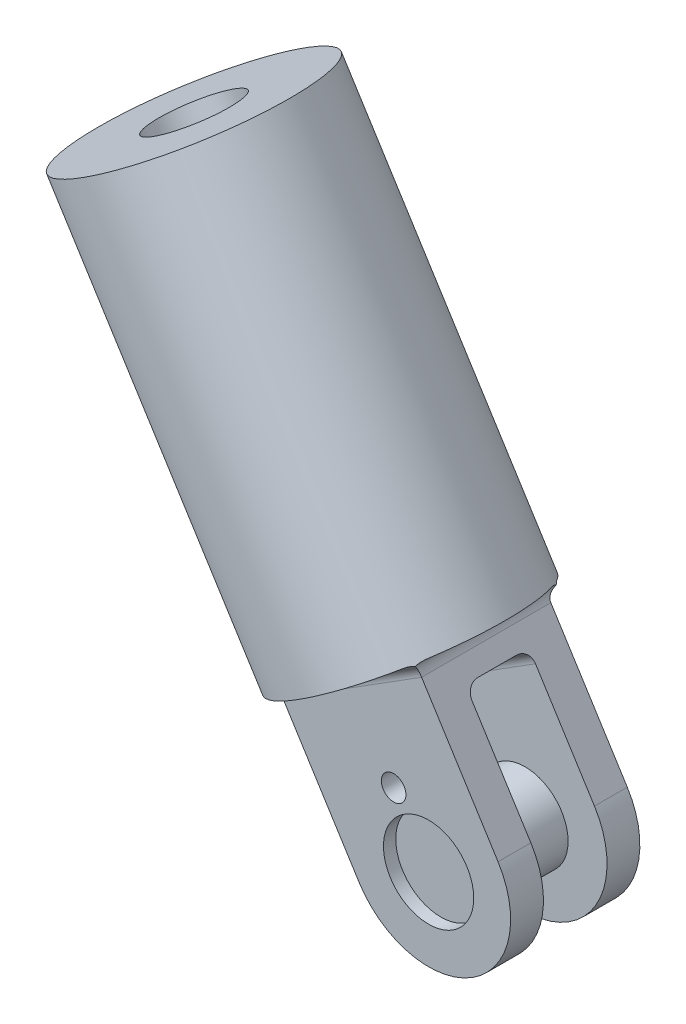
ISO-10303-21;
HEADER;
FILE_DESCRIPTION(('STEP AP214'),'2;1');
FILE_NAME('part.step','',(''),(''),'','','');
FILE_SCHEMA(('AUTOMOTIVE_DESIGN { 1 0 10303 214 1 1 1 1 }'));
ENDSEC;
DATA;
#1=APPLICATION_CONTEXT('core data for automotive mechanical design processes');
#2=APPLICATION_PROTOCOL_DEFINITION('international standard','automotive_design',2000,#1);
#3=PRODUCT_CONTEXT('',#1,'mechanical');
#4=PRODUCT('Part','Part','',(#3));
#5=PRODUCT_RELATED_PRODUCT_CATEGORY('part','',(#4));
#6=PRODUCT_DEFINITION_FORMATION('','',#4);
#7=PRODUCT_DEFINITION_CONTEXT('part definition',#1,'design');
#8=PRODUCT_DEFINITION('design','',#6,#7);
#9=PRODUCT_DEFINITION_SHAPE('','',#8);
#10=(LENGTH_UNIT() NAMED_UNIT(*) SI_UNIT(.MILLI.,.METRE.));
#11=(NAMED_UNIT(*) PLANE_ANGLE_UNIT() SI_UNIT($,.RADIAN.));
#12=(NAMED_UNIT(*) SI_UNIT($,.STERADIAN.) SOLID_ANGLE_UNIT());
#13=UNCERTAINTY_MEASURE_WITH_UNIT(LENGTH_MEASURE(1.E-05),#10,'distance_accuracy_value','');
#14=(GEOMETRIC_REPRESENTATION_CONTEXT(3) GLOBAL_UNCERTAINTY_ASSIGNED_CONTEXT((#13)) GLOBAL_UNIT_ASSIGNED_CONTEXT((#10,
#11,#12)) REPRESENTATION_CONTEXT('',''));
#15=CARTESIAN_POINT('',(0.,0.,0.));
#16=DIRECTION('',(0.,0.,1.));
#17=DIRECTION('',(1.,0.,0.));
#18=AXIS2_PLACEMENT_3D('',#15,#16,#17);
#19=CARTESIAN_POINT('',(30.0521732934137,5.94644816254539,-27.5));
#20=DIRECTION('',(0.,0.,1.));
#21=DIRECTION('',(1.,0.,0.));
#22=AXIS2_PLACEMENT_3D('',#19,#20,#21);
#23=CYLINDRICAL_SURFACE('',#22,11.);
#24=CARTESIAN_POINT('',(30.0521732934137,5.94644816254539,-15.75));
#25=DIRECTION('',(0.,0.,-1.));
#26=DIRECTION('',(-1.,0.,0.));
#27=AXIS2_PLACEMENT_3D('',#24,#25,#26);
#28=CIRCLE('',#27,11.);
#29=CARTESIAN_POINT('',(19.0521732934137,5.94644816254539,-15.75));
#30=VERTEX_POINT('',#29);
#31=EDGE_CURVE('E655',#30,#30,#28,.T.);
#32=ORIENTED_EDGE('',*,*,#31,.T.);
#33=EDGE_LOOP('',(#32));
#34=FACE_BOUND('',#33,.T.);
#35=CARTESIAN_POINT('',(30.0521732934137,5.94644816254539,-12.75));
#36=DIRECTION('',(0.,0.,1.));
#37=DIRECTION('',(1.,0.,0.));
#38=AXIS2_PLACEMENT_3D('',#35,#36,#37);
#39=CIRCLE('',#38,11.);
#40=CARTESIAN_POINT('',(41.0521732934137,5.94644816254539,-12.75));
#41=VERTEX_POINT('',#40);
#42=EDGE_CURVE('E11',#41,#41,#39,.F.);
#43=ORIENTED_EDGE('',*,*,#42,.F.);
#44=EDGE_LOOP('',(#43));
#45=FACE_BOUND('',#44,.T.);
#46=ADVANCED_FACE('F36',(#34,#45),#23,.F.);
#47=CARTESIAN_POINT('',(30.0521732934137,5.94644816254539,15.75));
#48=DIRECTION('',(0.,0.,1.));
#49=DIRECTION('',(1.,0.,0.));
#50=AXIS2_PLACEMENT_3D('',#47,#48,#49);
#51=CIRCLE('',#50,11.);
#52=CARTESIAN_POINT('',(41.0521732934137,5.94644816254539,15.75));
#53=VERTEX_POINT('',#52);
#54=EDGE_CURVE('E653',#53,#53,#51,.T.);
#55=ORIENTED_EDGE('',*,*,#54,.T.);
#56=EDGE_LOOP('',(#55));
#57=FACE_BOUND('',#56,.T.);
#58=CARTESIAN_POINT('',(30.0521732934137,5.94644816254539,12.75));
#59=DIRECTION('',(0.,0.,-1.));
#60=DIRECTION('',(-1.,0.,0.));
#61=AXIS2_PLACEMENT_3D('',#58,#59,#60);
#62=CIRCLE('',#61,11.);
#63=CARTESIAN_POINT('',(19.0521732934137,5.94644816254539,12.75));
#64=VERTEX_POINT('',#63);
#65=EDGE_CURVE('E45',#64,#64,#62,.F.);
#66=ORIENTED_EDGE('',*,*,#65,.F.);
#67=EDGE_LOOP('',(#66));
#68=FACE_BOUND('',#67,.T.);
#69=ADVANCED_FACE('F334',(#57,#68),#23,.F.);
#70=CARTESIAN_POINT('',(9.82377228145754,38.1149388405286,0.));
#71=DIRECTION('',(-0.532326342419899,0.846539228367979,0.));
#72=DIRECTION('',(-0.846539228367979,-0.532326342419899,0.));
#73=AXIS2_PLACEMENT_3D('',#70,#71,#72);
#74=PLANE('',#73);
#75=CARTESIAN_POINT('',(9.82377228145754,38.1149388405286,0.));
#76=DIRECTION('',(-0.532326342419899,0.846539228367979,0.));
#77=DIRECTION('',(-0.846539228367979,-0.532326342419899,0.));
#78=AXIS2_PLACEMENT_3D('',#75,#76,#77);
#79=CIRCLE('',#78,27.5);
#80=CARTESIAN_POINT('',(29.294174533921,50.3584447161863,15.0748134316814));
#81=VERTEX_POINT('',#80);
#82=CARTESIAN_POINT('',(29.294174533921,50.3584447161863,-15.0748134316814));
#83=VERTEX_POINT('',#82);
#84=EDGE_CURVE('E410',#81,#83,#79,.T.);
#85=ORIENTED_EDGE('',*,*,#84,.F.);
#86=DIRECTION('',(0.,0.,-1.));
#87=VECTOR('',#86,1.);
#88=CARTESIAN_POINT('',(29.294174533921,50.3584447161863,-15.75));
#89=LINE('',#88,#87);
#90=EDGE_CURVE('E237',#81,#83,#89,.T.);
#91=ORIENTED_EDGE('',*,*,#90,.T.);
#92=EDGE_LOOP('',(#85,#91));
#93=FACE_BOUND('',#92,.T.);
#94=ADVANCED_FACE('F336',(#93),#74,.F.);
#95=CARTESIAN_POINT('',(26.8534717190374,48.8236659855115,-18.75));
#96=VERTEX_POINT('',#95);
#97=CARTESIAN_POINT('',(-7.20592715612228,27.4062116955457,-18.75));
#98=VERTEX_POINT('',#97);
#99=EDGE_CURVE('E395',#96,#98,#79,.T.);
#100=ORIENTED_EDGE('',*,*,#99,.F.);
#101=DIRECTION('',(-0.846539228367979,-0.532326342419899,0.));
#102=VECTOR('',#101,1.);
#103=CARTESIAN_POINT('',(9.82377228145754,38.1149388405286,-18.75));
#104=LINE('',#103,#102);
#105=EDGE_CURVE('E235',#96,#98,#104,.T.);
#106=ORIENTED_EDGE('',*,*,#105,.T.);
#107=EDGE_LOOP('',(#100,#106));
#108=FACE_BOUND('',#107,.T.);
#109=ADVANCED_FACE('F343',(#108),#74,.F.);
#110=CARTESIAN_POINT('',(-9.646629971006,25.8714329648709,-15.0748134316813));
#111=VERTEX_POINT('',#110);
#112=CARTESIAN_POINT('',(-9.646629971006,25.8714329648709,15.0748134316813));
#113=VERTEX_POINT('',#112);
#114=EDGE_CURVE('E393',#111,#113,#79,.T.);
#115=ORIENTED_EDGE('',*,*,#114,.F.);
#116=DIRECTION('',(0.,0.,1.));
#117=VECTOR('',#116,1.);
#118=CARTESIAN_POINT('',(-9.646629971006,25.8714329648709,15.75));
#119=LINE('',#118,#117);
#120=EDGE_CURVE('E233',#111,#113,#119,.T.);
#121=ORIENTED_EDGE('',*,*,#120,.T.);
#122=EDGE_LOOP('',(#115,#121));
#123=FACE_BOUND('',#122,.T.);
#124=ADVANCED_FACE('F374',(#123),#74,.F.);
#125=CARTESIAN_POINT('',(13.1213887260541,-4.70007868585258,-15.75));
#126=DIRECTION('',(0.846539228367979,0.532326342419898,0.));
#127=DIRECTION('',(-0.532326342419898,0.846539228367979,0.));
#128=AXIS2_PLACEMENT_3D('',#125,#126,#127);
#129=PLANE('',#128);
#130=DIRECTION('',(0.532326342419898,-0.846539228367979,0.));
#131=VECTOR('',#130,1.);
#132=CARTESIAN_POINT('',(-102.93078456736,179.853473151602,15.75));
#133=LINE('',#132,#131);
#134=CARTESIAN_POINT('',(-5.51003325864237,24.9287943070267,15.75));
#135=VERTEX_POINT('',#134);
#136=CARTESIAN_POINT('',(13.1213887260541,-4.70007868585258,15.75));
#137=VERTEX_POINT('',#136);
#138=EDGE_CURVE('E203',#135,#137,#133,.T.);
#139=ORIENTED_EDGE('',*,*,#138,.F.);
#140=DIRECTION('',(0.,0.,1.));
#141=VECTOR('',#140,1.);
#142=CARTESIAN_POINT('',(-5.51003325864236,24.9287943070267,-15.75));
#143=LINE('',#142,#141);
#144=CARTESIAN_POINT('',(-5.51003325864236,24.9287943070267,-15.75));
#145=VERTEX_POINT('',#144);
#146=EDGE_CURVE('E245',#135,#145,#143,.F.);
#147=ORIENTED_EDGE('',*,*,#146,.T.);
#148=DIRECTION('',(-0.532326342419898,0.846539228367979,0.));
#149=VECTOR('',#148,1.);
#150=CARTESIAN_POINT('',(13.1213887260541,-4.70007868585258,-15.75));
#151=LINE('',#150,#149);
#152=CARTESIAN_POINT('',(13.1213887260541,-4.70007868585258,-15.75));
#153=VERTEX_POINT('',#152);
#154=EDGE_CURVE('E189',#153,#145,#151,.T.);
#155=ORIENTED_EDGE('',*,*,#154,.F.);
#156=DIRECTION('',(0.,0.,1.));
#157=VECTOR('',#156,1.);
#158=CARTESIAN_POINT('',(13.1213887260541,-4.70007868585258,-15.75));
#159=LINE('',#158,#157);
#160=CARTESIAN_POINT('',(13.1213887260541,-4.70007868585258,-7.75));
#161=VERTEX_POINT('',#160);
#162=EDGE_CURVE('E165',#153,#161,#159,.T.);
#163=ORIENTED_EDGE('',*,*,#162,.T.);
#164=DIRECTION('',(-0.532326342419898,0.846539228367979,0.));
#165=VECTOR('',#164,1.);
#166=CARTESIAN_POINT('',(13.1213887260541,-4.70007868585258,-7.75));
#167=LINE('',#166,#165);
#168=CARTESIAN_POINT('',(-1.25142251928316,18.1564804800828,-7.75));
#169=VERTEX_POINT('',#168);
#170=EDGE_CURVE('E179',#161,#169,#167,.T.);
#171=ORIENTED_EDGE('',*,*,#170,.T.);
#172=CARTESIAN_POINT('',(-1.25142251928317,18.1564804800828,-4.75));
#173=DIRECTION('',(0.846539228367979,0.532326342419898,0.));
#174=DIRECTION('',(-0.532326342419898,0.846539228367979,0.));
#175=AXIS2_PLACEMENT_3D('',#172,#173,#174);
#176=CIRCLE('',#175,3.);
#177=CARTESIAN_POINT('',(-2.84840154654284,20.6960981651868,-4.75));
#178=VERTEX_POINT('',#177);
#179=EDGE_CURVE('E228',#169,#178,#176,.T.);
#180=ORIENTED_EDGE('',*,*,#179,.T.);
#181=DIRECTION('',(0.,0.,1.));
#182=VECTOR('',#181,1.);
#183=CARTESIAN_POINT('',(-2.84840154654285,20.6960981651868,-15.75));
#184=LINE('',#183,#182);
#185=CARTESIAN_POINT('',(-2.84840154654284,20.6960981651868,4.75));
#186=VERTEX_POINT('',#185);
#187=EDGE_CURVE('E208',#178,#186,#184,.T.);
#188=ORIENTED_EDGE('',*,*,#187,.T.);
#189=CARTESIAN_POINT('',(-1.25142251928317,18.1564804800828,4.75));
#190=DIRECTION('',(0.846539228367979,0.532326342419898,0.));
#191=DIRECTION('',(-0.532326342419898,0.846539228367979,0.));
#192=AXIS2_PLACEMENT_3D('',#189,#190,#191);
#193=CIRCLE('',#192,3.);
#194=CARTESIAN_POINT('',(-1.25142251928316,18.1564804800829,7.75));
#195=VERTEX_POINT('',#194);
#196=EDGE_CURVE('E226',#186,#195,#193,.T.);
#197=ORIENTED_EDGE('',*,*,#196,.T.);
#198=DIRECTION('',(0.532326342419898,-0.846539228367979,0.));
#199=VECTOR('',#198,1.);
#200=CARTESIAN_POINT('',(-102.93078456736,179.853473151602,7.75));
#201=LINE('',#200,#199);
#202=CARTESIAN_POINT('',(13.1213887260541,-4.70007868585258,7.75));
#203=VERTEX_POINT('',#202);
#204=EDGE_CURVE('E193',#195,#203,#201,.T.);
#205=ORIENTED_EDGE('',*,*,#204,.T.);
#206=DIRECTION('',(0.,0.,-1.));
#207=VECTOR('',#206,1.);
#208=CARTESIAN_POINT('',(13.1213887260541,-4.70007868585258,15.75));
#209=LINE('',#208,#207);
#210=EDGE_CURVE('E195',#137,#203,#209,.T.);
#211=ORIENTED_EDGE('',*,*,#210,.F.);
#212=EDGE_LOOP('',(#139,#147,#155,#163,#171,#180,#188,#197,#205,#211));
#213=FACE_BOUND('',#212,.T.);
#214=ADVANCED_FACE('F383',(#213),#129,.F.);
#215=CARTESIAN_POINT('',(46.9829578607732,16.5929750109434,-15.75));
#216=DIRECTION('',(-0.846539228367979,-0.532326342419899,0.));
#217=DIRECTION('',(0.532326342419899,-0.846539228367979,0.));
#218=AXIS2_PLACEMENT_3D('',#215,#216,#217);
#219=PLANE('',#218);
#220=DIRECTION('',(0.532326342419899,-0.846539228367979,0.));
#221=VECTOR('',#220,1.);
#222=CARTESIAN_POINT('',(46.9829578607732,16.5929750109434,-15.75));
#223=LINE('',#222,#221);
#224=CARTESIAN_POINT('',(28.3515358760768,46.2218480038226,-15.75));
#225=VERTEX_POINT('',#224);
#226=CARTESIAN_POINT('',(46.9829578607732,16.5929750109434,-15.75));
#227=VERTEX_POINT('',#226);
#228=EDGE_CURVE('E164',#225,#227,#223,.T.);
#229=ORIENTED_EDGE('',*,*,#228,.F.);
#230=DIRECTION('',(0.,0.,-1.));
#231=VECTOR('',#230,1.);
#232=CARTESIAN_POINT('',(28.3515358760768,46.2218480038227,15.75));
#233=LINE('',#232,#231);
#234=CARTESIAN_POINT('',(28.3515358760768,46.2218480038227,15.75));
#235=VERTEX_POINT('',#234);
#236=EDGE_CURVE('E240',#225,#235,#233,.F.);
#237=ORIENTED_EDGE('',*,*,#236,.T.);
#238=DIRECTION('',(-0.532326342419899,0.846539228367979,0.));
#239=VECTOR('',#238,1.);
#240=CARTESIAN_POINT('',(46.9829578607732,16.5929750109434,15.75));
#241=LINE('',#240,#239);
#242=CARTESIAN_POINT('',(46.9829578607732,16.5929750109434,15.75));
#243=VERTEX_POINT('',#242);
#244=EDGE_CURVE('E181',#243,#235,#241,.T.);
#245=ORIENTED_EDGE('',*,*,#244,.F.);
#246=DIRECTION('',(0.,0.,-1.));
#247=VECTOR('',#246,1.);
#248=CARTESIAN_POINT('',(46.9829578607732,16.5929750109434,15.75));
#249=LINE('',#248,#247);
#250=CARTESIAN_POINT('',(46.9829578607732,16.5929750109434,7.75));
#251=VERTEX_POINT('',#250);
#252=EDGE_CURVE('E190',#243,#251,#249,.T.);
#253=ORIENTED_EDGE('',*,*,#252,.T.);
#254=DIRECTION('',(-0.532326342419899,0.846539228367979,0.));
#255=VECTOR('',#254,1.);
#256=CARTESIAN_POINT('',(46.9829578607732,16.5929750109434,7.75));
#257=LINE('',#256,#255);
#258=CARTESIAN_POINT('',(32.610146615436,39.4495341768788,7.75));
#259=VERTEX_POINT('',#258);
#260=EDGE_CURVE('E194',#251,#259,#257,.T.);
#261=ORIENTED_EDGE('',*,*,#260,.T.);
#262=CARTESIAN_POINT('',(32.610146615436,39.4495341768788,4.75));
#263=DIRECTION('',(-0.846539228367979,-0.532326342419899,0.));
#264=DIRECTION('',(0.532326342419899,-0.846539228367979,0.));
#265=AXIS2_PLACEMENT_3D('',#262,#263,#264);
#266=CIRCLE('',#265,3.);
#267=CARTESIAN_POINT('',(31.0131675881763,41.9891518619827,4.75));
#268=VERTEX_POINT('',#267);
#269=EDGE_CURVE('E224',#259,#268,#266,.T.);
#270=ORIENTED_EDGE('',*,*,#269,.T.);
#271=DIRECTION('',(0.,0.,-1.));
#272=VECTOR('',#271,1.);
#273=CARTESIAN_POINT('',(31.0131675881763,41.9891518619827,-15.75));
#274=LINE('',#273,#272);
#275=CARTESIAN_POINT('',(31.0131675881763,41.9891518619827,-4.75));
#276=VERTEX_POINT('',#275);
#277=EDGE_CURVE('E409',#268,#276,#274,.T.);
#278=ORIENTED_EDGE('',*,*,#277,.T.);
#279=CARTESIAN_POINT('',(32.610146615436,39.4495341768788,-4.75));
#280=DIRECTION('',(-0.846539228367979,-0.532326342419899,0.));
#281=DIRECTION('',(0.532326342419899,-0.846539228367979,0.));
#282=AXIS2_PLACEMENT_3D('',#279,#280,#281);
#283=CIRCLE('',#282,3.);
#284=CARTESIAN_POINT('',(32.610146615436,39.4495341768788,-7.75));
#285=VERTEX_POINT('',#284);
#286=EDGE_CURVE('E159',#276,#285,#283,.T.);
#287=ORIENTED_EDGE('',*,*,#286,.T.);
#288=DIRECTION('',(0.532326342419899,-0.846539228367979,0.));
#289=VECTOR('',#288,1.);
#290=CARTESIAN_POINT('',(46.9829578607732,16.5929750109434,-7.75));
#291=LINE('',#290,#289);
#292=CARTESIAN_POINT('',(46.9829578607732,16.5929750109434,-7.75));
#293=VERTEX_POINT('',#292);
#294=EDGE_CURVE('E151',#285,#293,#291,.T.);
#295=ORIENTED_EDGE('',*,*,#294,.T.);
#296=DIRECTION('',(0.,0.,1.));
#297=VECTOR('',#296,1.);
#298=CARTESIAN_POINT('',(46.9829578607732,16.5929750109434,-15.75));
#299=LINE('',#298,#297);
#300=EDGE_CURVE('E155',#227,#293,#299,.T.);
#301=ORIENTED_EDGE('',*,*,#300,.F.);
#302=EDGE_LOOP('',(#229,#237,#245,#253,#261,#270,#278,#287,#295,#301));
#303=FACE_BOUND('',#302,.T.);
#304=ADVANCED_FACE('F154',(#303),#219,.F.);
#305=CARTESIAN_POINT('',(30.0521732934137,5.94644816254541,-15.75));
#306=DIRECTION('',(0.,0.,-1.));
#307=DIRECTION('',(-1.,0.,0.));
#308=AXIS2_PLACEMENT_3D('',#305,#306,#307);
#309=PLANE('',#308);
#310=ORIENTED_EDGE('',*,*,#31,.F.);
#311=EDGE_LOOP('',(#310));
#312=FACE_BOUND('',#311,.T.);
#313=ORIENTED_EDGE('',*,*,#154,.T.);
#314=DIRECTION('',(-0.846539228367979,-0.532326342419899,0.));
#315=VECTOR('',#314,1.);
#316=CARTESIAN_POINT('',(11.4207513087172,35.5753211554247,-15.75));
#317=LINE('',#316,#315);
#318=EDGE_CURVE('E243',#145,#225,#317,.F.);
#319=ORIENTED_EDGE('',*,*,#318,.T.);
#320=ORIENTED_EDGE('',*,*,#228,.T.);
#321=CARTESIAN_POINT('',(30.0521732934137,5.94644816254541,-15.75));
#322=DIRECTION('',(0.,0.,-1.));
#323=DIRECTION('',(-1.,0.,0.));
#324=AXIS2_PLACEMENT_3D('',#321,#322,#323);
#325=CIRCLE('',#324,20.);
#326=EDGE_CURVE('E173',#227,#153,#325,.T.);
#327=ORIENTED_EDGE('',*,*,#326,.T.);
#328=EDGE_LOOP('',(#313,#319,#320,#327));
#329=FACE_BOUND('',#328,.T.);
#330=ADVANCED_FACE('F419',(#312,#329),#309,.T.);
#331=CARTESIAN_POINT('',(30.0521732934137,5.94644816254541,-7.75));
#332=DIRECTION('',(0.,0.,-1.));
#333=DIRECTION('',(-1.,0.,0.));
#334=AXIS2_PLACEMENT_3D('',#331,#332,#333);
#335=PLANE('',#334);
#336=ORIENTED_EDGE('',*,*,#294,.F.);
#337=DIRECTION('',(-0.846539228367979,-0.532326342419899,0.));
#338=VECTOR('',#337,1.);
#339=CARTESIAN_POINT('',(15.6793620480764,28.8030073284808,-7.75));
#340=LINE('',#339,#338);
#341=EDGE_CURVE('E222',#285,#169,#340,.T.);
#342=ORIENTED_EDGE('',*,*,#341,.T.);
#343=ORIENTED_EDGE('',*,*,#170,.F.);
#344=CARTESIAN_POINT('',(30.0521732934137,5.94644816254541,-7.75));
#345=DIRECTION('',(0.,0.,-1.));
#346=DIRECTION('',(-1.,0.,0.));
#347=AXIS2_PLACEMENT_3D('',#344,#345,#346);
#348=CIRCLE('',#347,20.);
#349=EDGE_CURVE('E171',#293,#161,#348,.T.);
#350=ORIENTED_EDGE('',*,*,#349,.F.);
#351=EDGE_LOOP('',(#336,#342,#343,#350));
#352=FACE_BOUND('',#351,.T.);
#353=CARTESIAN_POINT('',(30.0521732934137,5.94644816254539,-7.75));
#354=DIRECTION('',(0.,0.,1.));
#355=DIRECTION('',(1.,0.,0.));
#356=AXIS2_PLACEMENT_3D('',#353,#354,#355);
#357=CIRCLE('',#356,10.5);
#358=CARTESIAN_POINT('',(40.5521732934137,5.94644816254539,-7.75));
#359=VERTEX_POINT('',#358);
#360=EDGE_CURVE('E644',#359,#359,#357,.T.);
#361=ORIENTED_EDGE('',*,*,#360,.F.);
#362=EDGE_LOOP('',(#361));
#363=FACE_BOUND('',#362,.T.);
#364=ADVANCED_FACE('F176',(#352,#363),#335,.F.);
#365=CARTESIAN_POINT('',(30.0521732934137,5.94644816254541,15.75));
#366=DIRECTION('',(0.,0.,1.));
#367=DIRECTION('',(1.,0.,0.));
#368=AXIS2_PLACEMENT_3D('',#365,#366,#367);
#369=PLANE('',#368);
#370=CARTESIAN_POINT('',(21.5349518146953,19.4910758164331,15.75));
#371=DIRECTION('',(0.,0.,1.));
#372=DIRECTION('',(1.,0.,0.));
#373=AXIS2_PLACEMENT_3D('',#370,#371,#372);
#374=CIRCLE('',#373,3.);
#375=CARTESIAN_POINT('',(24.5349518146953,19.4910758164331,15.75));
#376=VERTEX_POINT('',#375);
#377=EDGE_CURVE('E650',#376,#376,#374,.T.);
#378=ORIENTED_EDGE('',*,*,#377,.F.);
#379=EDGE_LOOP('',(#378));
#380=FACE_BOUND('',#379,.T.);
#381=ORIENTED_EDGE('',*,*,#54,.F.);
#382=EDGE_LOOP('',(#381));
#383=FACE_BOUND('',#382,.T.);
#384=ORIENTED_EDGE('',*,*,#244,.T.);
#385=DIRECTION('',(0.846539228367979,0.532326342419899,0.));
#386=VECTOR('',#385,1.);
#387=CARTESIAN_POINT('',(11.4207513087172,35.5753211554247,15.75));
#388=LINE('',#387,#386);
#389=EDGE_CURVE('E247',#235,#135,#388,.F.);
#390=ORIENTED_EDGE('',*,*,#389,.T.);
#391=ORIENTED_EDGE('',*,*,#138,.T.);
#392=CARTESIAN_POINT('',(30.0521732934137,5.94644816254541,15.75));
#393=DIRECTION('',(0.,0.,1.));
#394=DIRECTION('',(1.,0.,0.));
#395=AXIS2_PLACEMENT_3D('',#392,#393,#394);
#396=CIRCLE('',#395,20.);
#397=EDGE_CURVE('E184',#137,#243,#396,.T.);
#398=ORIENTED_EDGE('',*,*,#397,.T.);
#399=EDGE_LOOP('',(#384,#390,#391,#398));
#400=FACE_BOUND('',#399,.T.);
#401=ADVANCED_FACE('F431',(#380,#383,#400),#369,.T.);
#402=CARTESIAN_POINT('',(30.0521732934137,5.94644816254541,7.75));
#403=DIRECTION('',(0.,0.,1.));
#404=DIRECTION('',(1.,0.,0.));
#405=AXIS2_PLACEMENT_3D('',#402,#403,#404);
#406=PLANE('',#405);
#407=CARTESIAN_POINT('',(21.5349518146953,19.4910758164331,7.75));
#408=DIRECTION('',(0.,0.,1.));
#409=DIRECTION('',(1.,0.,0.));
#410=AXIS2_PLACEMENT_3D('',#407,#408,#409);
#411=CIRCLE('',#410,3.);
#412=CARTESIAN_POINT('',(24.5349518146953,19.4910758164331,7.75));
#413=VERTEX_POINT('',#412);
#414=EDGE_CURVE('E329',#413,#413,#411,.F.);
#415=ORIENTED_EDGE('',*,*,#414,.F.);
#416=EDGE_LOOP('',(#415));
#417=FACE_BOUND('',#416,.T.);
#418=ORIENTED_EDGE('',*,*,#204,.F.);
#419=DIRECTION('',(0.846539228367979,0.532326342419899,0.));
#420=VECTOR('',#419,1.);
#421=CARTESIAN_POINT('',(15.6793620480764,28.8030073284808,7.75));
#422=LINE('',#421,#420);
#423=EDGE_CURVE('E215',#195,#259,#422,.T.);
#424=ORIENTED_EDGE('',*,*,#423,.T.);
#425=ORIENTED_EDGE('',*,*,#260,.F.);
#426=CARTESIAN_POINT('',(30.0521732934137,5.94644816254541,7.75));
#427=DIRECTION('',(0.,0.,1.));
#428=DIRECTION('',(1.,0.,0.));
#429=AXIS2_PLACEMENT_3D('',#426,#427,#428);
#430=CIRCLE('',#429,20.);
#431=EDGE_CURVE('E174',#203,#251,#430,.T.);
#432=ORIENTED_EDGE('',*,*,#431,.F.);
#433=EDGE_LOOP('',(#418,#424,#425,#432));
#434=FACE_BOUND('',#433,.T.);
#435=CARTESIAN_POINT('',(30.0521732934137,5.94644816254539,7.75));
#436=DIRECTION('',(0.,0.,-1.));
#437=DIRECTION('',(-1.,0.,0.));
#438=AXIS2_PLACEMENT_3D('',#435,#436,#437);
#439=CIRCLE('',#438,10.5);
#440=CARTESIAN_POINT('',(40.5521732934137,5.94644816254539,7.75));
#441=VERTEX_POINT('',#440);
#442=EDGE_CURVE('E322',#441,#441,#439,.T.);
#443=ORIENTED_EDGE('',*,*,#442,.F.);
#444=EDGE_LOOP('',(#443));
#445=FACE_BOUND('',#444,.T.);
#446=ADVANCED_FACE('F440',(#417,#434,#445),#406,.F.);
#447=CARTESIAN_POINT('',(30.0521732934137,5.94644816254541,-15.75));
#448=DIRECTION('',(0.,0.,1.));
#449=DIRECTION('',(1.,0.,0.));
#450=AXIS2_PLACEMENT_3D('',#447,#448,#449);
#451=CYLINDRICAL_SURFACE('',#450,20.);
#452=ORIENTED_EDGE('',*,*,#349,.T.);
#453=ORIENTED_EDGE('',*,*,#162,.F.);
#454=ORIENTED_EDGE('',*,*,#326,.F.);
#455=ORIENTED_EDGE('',*,*,#300,.T.);
#456=EDGE_LOOP('',(#452,#453,#454,#455));
#457=FACE_BOUND('',#456,.T.);
#458=ADVANCED_FACE('F169',(#457),#451,.T.);
#459=CARTESIAN_POINT('',(30.0521732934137,5.94644816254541,15.75));
#460=DIRECTION('',(0.,0.,-1.));
#461=DIRECTION('',(-1.,0.,0.));
#462=AXIS2_PLACEMENT_3D('',#459,#460,#461);
#463=CYLINDRICAL_SURFACE('',#462,20.);
#464=ORIENTED_EDGE('',*,*,#431,.T.);
#465=ORIENTED_EDGE('',*,*,#252,.F.);
#466=ORIENTED_EDGE('',*,*,#397,.F.);
#467=ORIENTED_EDGE('',*,*,#210,.T.);
#468=EDGE_LOOP('',(#464,#465,#466,#467));
#469=FACE_BOUND('',#468,.T.);
#470=ADVANCED_FACE('F379',(#469),#463,.T.);
#471=CARTESIAN_POINT('',(-10.133544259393,16.1150070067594,0.));
#472=DIRECTION('',(0.532326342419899,-0.846539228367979,0.));
#473=DIRECTION('',(0.846539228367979,0.532326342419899,0.));
#474=AXIS2_PLACEMENT_3D('',#471,#472,#473);
#475=PLANE('',#474);
#476=ORIENTED_EDGE('',*,*,#277,.F.);
#477=DIRECTION('',(0.846539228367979,0.532326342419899,0.));
#478=VECTOR('',#477,1.);
#479=CARTESIAN_POINT('',(-10.133544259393,16.1150070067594,4.75));
#480=LINE('',#479,#478);
#481=EDGE_CURVE('E220',#268,#186,#480,.F.);
#482=ORIENTED_EDGE('',*,*,#481,.T.);
#483=ORIENTED_EDGE('',*,*,#187,.F.);
#484=DIRECTION('',(-0.846539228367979,-0.532326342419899,0.));
#485=VECTOR('',#484,1.);
#486=CARTESIAN_POINT('',(-10.133544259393,16.1150070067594,-4.75));
#487=LINE('',#486,#485);
#488=EDGE_CURVE('E218',#178,#276,#487,.F.);
#489=ORIENTED_EDGE('',*,*,#488,.T.);
#490=EDGE_LOOP('',(#476,#482,#483,#489));
#491=FACE_BOUND('',#490,.T.);
#492=ADVANCED_FACE('F372',(#491),#475,.T.);
#493=CARTESIAN_POINT('',(-7.20592715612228,27.4062116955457,18.75));
#494=VERTEX_POINT('',#493);
#495=CARTESIAN_POINT('',(26.8534717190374,48.8236659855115,18.75));
#496=VERTEX_POINT('',#495);
#497=EDGE_CURVE('E398',#494,#496,#79,.T.);
#498=ORIENTED_EDGE('',*,*,#497,.F.);
#499=DIRECTION('',(0.846539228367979,0.532326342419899,0.));
#500=VECTOR('',#499,1.);
#501=CARTESIAN_POINT('',(9.82377228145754,38.1149388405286,18.75));
#502=LINE('',#501,#500);
#503=EDGE_CURVE('E231',#494,#496,#502,.T.);
#504=ORIENTED_EDGE('',*,*,#503,.T.);
#505=EDGE_LOOP('',(#498,#504));
#506=FACE_BOUND('',#505,.T.);
#507=ADVANCED_FACE('F345',(#506),#74,.F.);
#508=CARTESIAN_POINT('',(5.56516154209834,44.8872526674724,0.));
#509=DIRECTION('',(0.532326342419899,-0.846539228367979,0.));
#510=DIRECTION('',(0.846539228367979,0.532326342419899,0.));
#511=AXIS2_PLACEMENT_3D('',#508,#509,#510);
#512=CYLINDRICAL_SURFACE('',#511,27.5);
#513=CARTESIAN_POINT('',(-9.646629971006,25.8714329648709,15.0748134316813));
#514=CARTESIAN_POINT('',(-9.5945907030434,25.9041507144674,15.1685996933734));
#515=CARTESIAN_POINT('',(-9.54107103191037,25.9355797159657,15.2619987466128));
#516=CARTESIAN_POINT('',(-9.43099292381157,25.9956155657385,15.4479345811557));
#517=CARTESIAN_POINT('',(-9.37443387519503,26.0242218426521,15.540471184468));
#518=CARTESIAN_POINT('',(-9.20111708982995,26.1049526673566,15.8150084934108));
#519=CARTESIAN_POINT('',(-9.07982223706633,26.1525628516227,15.9955610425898));
#520=CARTESIAN_POINT('',(-8.8886296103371,26.2128876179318,16.2623008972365));
#521=CARTESIAN_POINT('',(-8.82332376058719,26.2311534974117,16.3505736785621));
#522=CARTESIAN_POINT('',(-8.68962038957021,26.2635674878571,16.5255161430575));
#523=CARTESIAN_POINT('',(-8.62122332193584,26.27771620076,16.6121860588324));
#524=CARTESIAN_POINT('',(-8.48076263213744,26.3015398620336,16.7843746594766));
#525=CARTESIAN_POINT('',(-8.40867314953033,26.3111764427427,16.8698776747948));
#526=CARTESIAN_POINT('',(-8.26138172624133,26.3252458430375,17.0386816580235));
#527=CARTESIAN_POINT('',(-8.18617799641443,26.3296756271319,17.1219813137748));
#528=CARTESIAN_POINT('',(-8.10946993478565,26.3312188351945,17.2039775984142));
#529=B_SPLINE_CURVE_WITH_KNOTS('',3,(#513,#514,#515,#516,#517,#518,#519,#520,#521,#522,#523,
#524,#525,#526,#527,#528),.UNSPECIFIED.,.F.,.F.,(4,2,2,2,2,2,2,4),(0.,0.336358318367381,
0.672784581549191,1.33982420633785,1.67366158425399,2.00745012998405,2.34402759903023,
2.68080119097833),.UNSPECIFIED.);
#530=CARTESIAN_POINT('',(-8.10946993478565,26.3312188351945,17.2039775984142));
#531=VERTEX_POINT('',#530);
#532=EDGE_CURVE('E52',#113,#531,#529,.T.);
#533=ORIENTED_EDGE('',*,*,#532,.T.);
#534=CARTESIAN_POINT('',(-8.10946993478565,26.3312188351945,17.2039775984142));
#535=CARTESIAN_POINT('',(-8.07685433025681,26.4163101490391,17.2949118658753));
#536=CARTESIAN_POINT('',(-8.03938637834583,26.4978001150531,17.3873605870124));
#537=CARTESIAN_POINT('',(-7.95558571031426,26.6535439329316,17.5741861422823));
#538=CARTESIAN_POINT('',(-7.90926025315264,26.7278036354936,17.6685613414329));
#539=CARTESIAN_POINT('',(-7.80935579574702,26.8680312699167,17.8567328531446));
#540=CARTESIAN_POINT('',(-7.75590841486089,26.9341153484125,17.9505132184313));
#541=CARTESIAN_POINT('',(-7.64189290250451,27.0594812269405,18.1382643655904));
#542=CARTESIAN_POINT('',(-7.58132560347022,27.1187638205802,18.2322351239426));
#543=CARTESIAN_POINT('',(-7.46930093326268,27.2169684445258,18.3968283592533));
#544=CARTESIAN_POINT('',(-7.41923118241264,27.2573271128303,18.467548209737));
#545=CARTESIAN_POINT('',(-7.31530686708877,27.3345076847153,18.6089634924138));
#546=CARTESIAN_POINT('',(-7.26143024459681,27.3713054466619,18.6796559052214));
#547=CARTESIAN_POINT('',(-7.20592715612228,27.4062116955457,18.75));
#548=B_SPLINE_CURVE_WITH_KNOTS('',3,(#534,#535,#536,#537,#538,#539,#540,#541,#542,#543,#544,
#545,#546,#547),.UNSPECIFIED.,.F.,.F.,(4,2,2,2,2,2,4),(0.,0.385945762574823,0.771576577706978,
1.15087418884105,1.53012749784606,1.81675943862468,2.10521544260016),.UNSPECIFIED.);
#549=EDGE_CURVE('E312',#531,#494,#548,.T.);
#550=ORIENTED_EDGE('',*,*,#549,.T.);
#551=ORIENTED_EDGE('',*,*,#497,.T.);
#552=CARTESIAN_POINT('',(26.8534717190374,48.8236659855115,18.75));
#553=CARTESIAN_POINT('',(26.9273050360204,48.8700836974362,18.6564407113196));
#554=CARTESIAN_POINT('',(27.0029191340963,48.912470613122,18.5622367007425));
#555=CARTESIAN_POINT('',(27.1576416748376,48.9886376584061,18.3729793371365));
#556=CARTESIAN_POINT('',(27.2367549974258,49.0224052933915,18.2779249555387));
#557=CARTESIAN_POINT('',(27.396711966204,49.080116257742,18.0894275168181));
#558=CARTESIAN_POINT('',(27.4774971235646,49.1042286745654,17.9959869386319));
#559=CARTESIAN_POINT('',(27.6419098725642,49.1428477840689,17.8097327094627));
#560=CARTESIAN_POINT('',(27.725535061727,49.157362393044,17.7169186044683));
#561=CARTESIAN_POINT('',(27.8759797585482,49.1739926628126,17.5537764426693));
#562=CARTESIAN_POINT('',(27.9422641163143,49.1781860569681,17.4831647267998));
#563=CARTESIAN_POINT('',(28.0767399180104,49.1801715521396,17.3427276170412));
#564=CARTESIAN_POINT('',(28.1449415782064,49.1779178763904,17.2729113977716));
#565=CARTESIAN_POINT('',(28.2137973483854,49.1722536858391,17.2039775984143));
#566=B_SPLINE_CURVE_WITH_KNOTS('',3,(#552,#553,#554,#555,#556,#557,#558,#559,#560,#561,#562,
#563,#564,#565),.UNSPECIFIED.,.F.,.F.,(4,2,2,2,2,2,4),(0.,0.383689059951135,0.767931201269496,
1.14511436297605,1.52198603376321,1.81258456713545,2.10525157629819),.UNSPECIFIED.);
#567=CARTESIAN_POINT('',(28.2137973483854,49.1722536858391,17.2039775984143));
#568=VERTEX_POINT('',#567);
#569=EDGE_CURVE('E306',#496,#568,#566,.T.);
#570=ORIENTED_EDGE('',*,*,#569,.T.);
#571=CARTESIAN_POINT('',(28.2137973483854,49.1722536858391,17.2039775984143));
#572=CARTESIAN_POINT('',(28.2418761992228,49.2277873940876,17.1374727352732));
#573=CARTESIAN_POINT('',(28.2712429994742,49.2816025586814,17.0701113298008));
#574=CARTESIAN_POINT('',(28.3322505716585,49.385884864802,16.9338826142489));
#575=CARTESIAN_POINT('',(28.3638905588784,49.4363531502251,16.8650158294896));
#576=CARTESIAN_POINT('',(28.4616974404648,49.5827758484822,16.6566130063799));
#577=CARTESIAN_POINT('',(28.5308396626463,49.6739186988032,16.5150682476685));
#578=CARTESIAN_POINT('',(28.6742868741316,49.8430935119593,16.2296332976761));
#579=CARTESIAN_POINT('',(28.7485209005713,49.9212681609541,16.085790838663));
#580=CARTESIAN_POINT('',(28.901511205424,50.0665931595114,15.7949713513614));
#581=CARTESIAN_POINT('',(28.9802677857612,50.133742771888,15.6479941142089));
#582=CARTESIAN_POINT('',(29.0988722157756,50.2250777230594,15.4295942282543));
#583=CARTESIAN_POINT('',(29.1373937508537,50.2532821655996,15.3590989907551));
#584=CARTESIAN_POINT('',(29.2152331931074,50.3075105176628,15.2174151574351));
#585=CARTESIAN_POINT('',(29.2545530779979,50.3335278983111,15.1462251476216));
#586=CARTESIAN_POINT('',(29.294174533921,50.3584447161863,15.0748134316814));
#587=B_SPLINE_CURVE_WITH_KNOTS('',3,(#571,#572,#573,#574,#575,#576,#577,#578,#579,#580,#581,
#582,#583,#584,#585,#586),.UNSPECIFIED.,.F.,.F.,(4,2,2,2,2,2,2,4),(0.,0.273164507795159,
0.54623516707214,1.09153400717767,1.63036504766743,2.16923210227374,2.42462748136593,
2.68076003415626),.UNSPECIFIED.);
#588=EDGE_CURVE('E257',#568,#81,#587,.T.);
#589=ORIENTED_EDGE('',*,*,#588,.T.);
#590=ORIENTED_EDGE('',*,*,#84,.T.);
#591=CARTESIAN_POINT('',(29.294174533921,50.3584447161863,-15.0748134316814));
#592=CARTESIAN_POINT('',(29.2421406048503,50.3257184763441,-15.1685996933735));
#593=CARTESIAN_POINT('',(29.1906267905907,50.2910996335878,-15.2619987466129));
#594=CARTESIAN_POINT('',(29.0888261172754,50.2179004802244,-15.4479345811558));
#595=CARTESIAN_POINT('',(29.0385395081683,50.1793193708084,-15.5404711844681));
#596=CARTESIAN_POINT('',(28.8906884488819,50.0580913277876,-15.8150084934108));
#597=CARTESIAN_POINT('',(28.7952269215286,49.969399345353,-15.9955610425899));
#598=CARTESIAN_POINT('',(28.658022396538,49.8232192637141,-16.2623008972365));
#599=CARTESIAN_POINT('',(28.6132656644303,49.7722748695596,-16.3505736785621));
#600=CARTESIAN_POINT('',(28.526123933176,49.6658155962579,-16.5255161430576));
#601=CARTESIAN_POINT('',(28.483738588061,49.6103013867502,-16.6121860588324));
#602=CARTESIAN_POINT('',(28.4014114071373,49.4940301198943,-16.7843746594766));
#603=CARTESIAN_POINT('',(28.3614929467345,49.4332331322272,-16.8698776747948));
#604=CARTESIAN_POINT('',(28.2849975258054,49.3065794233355,-17.0386816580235));
#605=CARTESIAN_POINT('',(28.2484225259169,49.2407197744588,-17.1219813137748));
#606=CARTESIAN_POINT('',(28.2137973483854,49.1722536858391,-17.2039775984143));
#607=B_SPLINE_CURVE_WITH_KNOTS('',3,(#591,#592,#593,#594,#595,#596,#597,#598,#599,#600,#601,
#602,#603,#604,#605,#606),.UNSPECIFIED.,.F.,.F.,(4,2,2,2,2,2,2,4),(0.,0.336358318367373,
0.67278458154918,1.33982420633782,1.67366158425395,2.00745012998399,2.34402759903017,
2.68080119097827),.UNSPECIFIED.);
#608=CARTESIAN_POINT('',(28.2137973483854,49.1722536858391,-17.2039775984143));
#609=VERTEX_POINT('',#608);
#610=EDGE_CURVE('E249',#83,#609,#607,.T.);
#611=ORIENTED_EDGE('',*,*,#610,.T.);
#612=CARTESIAN_POINT('',(28.2137973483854,49.1722536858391,-17.2039775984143));
#613=CARTESIAN_POINT('',(28.1229761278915,49.1797246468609,-17.2949118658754));
#614=CARTESIAN_POINT('',(28.033298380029,49.1812620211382,-17.3873605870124));
#615=CARTESIAN_POINT('',(27.856623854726,49.1732121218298,-17.5741861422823));
#616=CARTESIAN_POINT('',(27.769624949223,49.1636339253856,-17.6685613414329));
#617=CARTESIAN_POINT('',(27.5999576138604,49.1343476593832,-17.8567328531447));
#618=CARTESIAN_POINT('',(27.5172415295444,49.114808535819,-17.9505132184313));
#619=CARTESIAN_POINT('',(27.3548549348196,49.0663654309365,-18.1382643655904));
#620=CARTESIAN_POINT('',(27.2751840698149,49.0374625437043,-18.2322351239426));
#621=CARTESIAN_POINT('',(27.1381396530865,48.9790459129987,-18.3968283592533));
#622=CARTESIAN_POINT('',(27.0800724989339,48.951405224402,-18.4675482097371));
#623=CARTESIAN_POINT('',(26.9654859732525,48.8911803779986,-18.6089634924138));
#624=CARTESIAN_POINT('',(26.9089788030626,48.8585658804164,-18.6796559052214));
#625=CARTESIAN_POINT('',(26.8534717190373,48.8236659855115,-18.75));
#626=B_SPLINE_CURVE_WITH_KNOTS('',3,(#612,#613,#614,#615,#616,#617,#618,#619,#620,#621,#622,
#623,#624,#625),.UNSPECIFIED.,.F.,.F.,(4,2,2,2,2,2,4),(0.,0.385945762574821,0.771576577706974,
1.15087418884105,1.53012749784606,1.81675943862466,2.10521544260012),.UNSPECIFIED.);
#627=EDGE_CURVE('E289',#609,#96,#626,.T.);
#628=ORIENTED_EDGE('',*,*,#627,.T.);
#629=ORIENTED_EDGE('',*,*,#99,.T.);
#630=CARTESIAN_POINT('',(-7.20592715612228,27.4062116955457,-18.75));
#631=CARTESIAN_POINT('',(-7.27975088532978,27.3597787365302,-18.6564407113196));
#632=CARTESIAN_POINT('',(-7.35071331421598,27.3099944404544,-18.5622367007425));
#633=CARTESIAN_POINT('',(-7.48639508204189,27.2035475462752,-18.3729793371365));
#634=CARTESIAN_POINT('',(-7.55110527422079,27.1468751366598,-18.2779249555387));
#635=CARTESIAN_POINT('',(-7.67242097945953,27.027714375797,-18.0894275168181));
#636=CARTESIAN_POINT('',(-7.7291535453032,26.9653519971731,-17.9959869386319));
#637=CARTESIAN_POINT('',(-7.83519282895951,26.8339036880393,-17.8097327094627));
#638=CARTESIAN_POINT('',(-7.8845056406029,26.7648233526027,-17.7169186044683));
#639=CARTESIAN_POINT('',(-7.96467527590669,26.6364372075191,-17.5537764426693));
#640=CARTESIAN_POINT('',(-7.99717284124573,26.5785139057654,-17.4831647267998));
#641=CARTESIAN_POINT('',(-8.05722493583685,26.4581750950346,-17.3427276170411));
#642=CARTESIAN_POINT('',(-8.0847426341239,26.3957305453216,-17.2729113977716));
#643=CARTESIAN_POINT('',(-8.10946993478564,26.3312188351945,-17.2039775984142));
#644=B_SPLINE_CURVE_WITH_KNOTS('',3,(#630,#631,#632,#633,#634,#635,#636,#637,#638,#639,#640,
#641,#642,#643),.UNSPECIFIED.,.F.,.F.,(4,2,2,2,2,2,4),(0.,0.383689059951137,0.767931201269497,
1.14511436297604,1.52198603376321,1.81258456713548,2.10525157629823),.UNSPECIFIED.);
#645=CARTESIAN_POINT('',(-8.10946993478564,26.3312188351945,-17.2039775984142));
#646=VERTEX_POINT('',#645);
#647=EDGE_CURVE('E59',#98,#646,#644,.T.);
#648=ORIENTED_EDGE('',*,*,#647,.T.);
#649=CARTESIAN_POINT('',(-8.10946993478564,26.3312188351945,-17.2039775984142));
#650=CARTESIAN_POINT('',(-8.17168618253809,26.3299725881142,-17.1374727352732));
#651=CARTESIAN_POINT('',(-8.23291157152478,26.3268209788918,-17.0701113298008));
#652=CARTESIAN_POINT('',(-8.35333009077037,26.3170177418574,-16.9338826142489));
#653=CARTESIAN_POINT('',(-8.41252391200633,26.3103673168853,-16.8650158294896));
#654=CARTESIAN_POINT('',(-8.58686588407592,26.2856555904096,-16.6566130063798));
#655=CARTESIAN_POINT('',(-8.69896659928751,26.2628280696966,-16.5150682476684));
#656=CARTESIAN_POINT('',(-8.91358838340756,26.2068395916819,-16.2296332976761));
#657=CARTESIAN_POINT('',(-9.01620730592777,26.1738044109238,-16.0857908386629));
#658=CARTESIAN_POINT('',(-9.21346857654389,26.0988819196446,-15.7949713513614));
#659=CARTESIAN_POINT('',(-9.30811039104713,26.0569940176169,-15.6479941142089));
#660=CARTESIAN_POINT('',(-9.44181410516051,25.989670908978,-15.4295942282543));
#661=CARTESIAN_POINT('',(-9.48392366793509,25.9671723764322,-15.3590989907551));
#662=CARTESIAN_POINT('',(-9.56652257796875,25.9205128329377,-15.217415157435));
#663=CARTESIAN_POINT('',(-9.60700689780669,25.8963472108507,-15.1462251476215));
#664=CARTESIAN_POINT('',(-9.646629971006,25.8714329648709,-15.0748134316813));
#665=B_SPLINE_CURVE_WITH_KNOTS('',3,(#649,#650,#651,#652,#653,#654,#655,#656,#657,#658,#659,
#660,#661,#662,#663,#664),.UNSPECIFIED.,.F.,.F.,(4,2,2,2,2,2,2,4),(0.,0.273164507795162,
0.546235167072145,1.09153400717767,1.63036504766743,2.16923210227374,2.42462748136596,
2.68076003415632),.UNSPECIFIED.);
#666=EDGE_CURVE('E300',#646,#111,#665,.T.);
#667=ORIENTED_EDGE('',*,*,#666,.T.);
#668=ORIENTED_EDGE('',*,*,#114,.T.);
#669=EDGE_LOOP('',(#533,#550,#551,#570,#589,#590,#611,#628,#629,#648,#667,#668));
#670=FACE_BOUND('',#669,.T.);
#671=CARTESIAN_POINT('',(-42.8765356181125,121.922322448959,0.));
#672=DIRECTION('',(-0.532326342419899,0.846539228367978,0.));
#673=DIRECTION('',(-0.846539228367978,-0.532326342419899,0.));
#674=AXIS2_PLACEMENT_3D('',#671,#672,#673);
#675=CIRCLE('',#674,27.5);
#676=CARTESIAN_POINT('',(-66.1563643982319,107.283348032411,0.));
#677=VERTEX_POINT('',#676);
#678=EDGE_CURVE('E662',#677,#677,#675,.T.);
#679=ORIENTED_EDGE('',*,*,#678,.F.);
#680=EDGE_LOOP('',(#679));
#681=FACE_BOUND('',#680,.T.);
#682=ADVANCED_FACE('F263',(#670,#681),#512,.T.);
#683=CARTESIAN_POINT('',(-39.6825775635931,116.843087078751,0.));
#684=DIRECTION('',(-0.532326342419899,0.846539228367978,0.));
#685=DIRECTION('',(-0.846539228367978,-0.532326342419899,0.));
#686=AXIS2_PLACEMENT_3D('',#683,#684,#685);
#687=PLANE('',#686);
#688=CARTESIAN_POINT('',(-39.6825775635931,116.843087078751,0.));
#689=DIRECTION('',(-0.532326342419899,0.846539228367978,0.));
#690=DIRECTION('',(-0.846539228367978,-0.532326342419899,0.));
#691=AXIS2_PLACEMENT_3D('',#688,#689,#690);
#692=CIRCLE('',#691,10.125);
#693=CARTESIAN_POINT('',(-48.2537872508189,111.453282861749,0.));
#694=VERTEX_POINT('',#693);
#695=EDGE_CURVE('E658',#694,#694,#692,.T.);
#696=ORIENTED_EDGE('',*,*,#695,.T.);
#697=EDGE_LOOP('',(#696));
#698=FACE_BOUND('',#697,.T.);
#699=CARTESIAN_POINT('',(-39.6825775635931,116.843087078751,0.));
#700=DIRECTION('',(-0.532326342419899,0.846539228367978,0.));
#701=DIRECTION('',(-0.846539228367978,-0.532326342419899,0.));
#702=AXIS2_PLACEMENT_3D('',#699,#700,#701);
#703=CIRCLE('',#702,21.5);
#704=CARTESIAN_POINT('',(-57.8831709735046,105.398070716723,0.));
#705=VERTEX_POINT('',#704);
#706=EDGE_CURVE('E396',#705,#705,#703,.T.);
#707=ORIENTED_EDGE('',*,*,#706,.F.);
#708=EDGE_LOOP('',(#707));
#709=FACE_BOUND('',#708,.T.);
#710=ADVANCED_FACE('F360',(#698,#709),#687,.F.);
#711=CARTESIAN_POINT('',(-42.8765356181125,121.922322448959,0.));
#712=DIRECTION('',(-0.532326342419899,0.846539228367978,0.));
#713=DIRECTION('',(-0.846539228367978,-0.532326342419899,0.));
#714=AXIS2_PLACEMENT_3D('',#711,#712,#713);
#715=PLANE('',#714);
#716=ORIENTED_EDGE('',*,*,#678,.T.);
#717=EDGE_LOOP('',(#716));
#718=FACE_BOUND('',#717,.T.);
#719=CARTESIAN_POINT('',(-42.8765356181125,121.922322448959,0.));
#720=DIRECTION('',(-0.532326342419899,0.846539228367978,0.));
#721=DIRECTION('',(-0.846539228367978,-0.532326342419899,0.));
#722=AXIS2_PLACEMENT_3D('',#719,#720,#721);
#723=CIRCLE('',#722,10.125);
#724=CARTESIAN_POINT('',(-51.4477453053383,116.532518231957,0.));
#725=VERTEX_POINT('',#724);
#726=EDGE_CURVE('E659',#725,#725,#723,.T.);
#727=ORIENTED_EDGE('',*,*,#726,.F.);
#728=EDGE_LOOP('',(#727));
#729=FACE_BOUND('',#728,.T.);
#730=ADVANCED_FACE('F356',(#718,#729),#715,.T.);
#731=CARTESIAN_POINT('',(-42.8765356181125,121.922322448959,0.));
#732=DIRECTION('',(0.532326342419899,-0.846539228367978,0.));
#733=DIRECTION('',(0.846539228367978,0.532326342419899,0.));
#734=AXIS2_PLACEMENT_3D('',#731,#732,#733);
#735=CYLINDRICAL_SURFACE('',#734,10.125);
#736=ORIENTED_EDGE('',*,*,#726,.T.);
#737=EDGE_LOOP('',(#736));
#738=FACE_BOUND('',#737,.T.);
#739=ORIENTED_EDGE('',*,*,#695,.F.);
#740=EDGE_LOOP('',(#739));
#741=FACE_BOUND('',#740,.T.);
#742=ADVANCED_FACE('F352',(#738,#741),#735,.F.);
#743=CARTESIAN_POINT('',(5.56516154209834,44.8872526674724,0.));
#744=DIRECTION('',(-0.532326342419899,0.846539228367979,0.));
#745=DIRECTION('',(-0.846539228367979,-0.532326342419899,0.));
#746=AXIS2_PLACEMENT_3D('',#743,#744,#745);
#747=PLANE('',#746);
#748=CARTESIAN_POINT('',(5.56516154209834,44.8872526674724,0.));
#749=DIRECTION('',(-0.532326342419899,0.846539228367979,0.));
#750=DIRECTION('',(-0.846539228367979,-0.532326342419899,0.));
#751=AXIS2_PLACEMENT_3D('',#748,#749,#750);
#752=CIRCLE('',#751,21.5);
#753=CARTESIAN_POINT('',(-12.6354318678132,33.4422363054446,0.));
#754=VERTEX_POINT('',#753);
#755=EDGE_CURVE('E198',#754,#754,#752,.F.);
#756=ORIENTED_EDGE('',*,*,#755,.F.);
#757=EDGE_LOOP('',(#756));
#758=FACE_BOUND('',#757,.T.);
#759=ADVANCED_FACE('F355',(#758),#747,.T.);
#760=CARTESIAN_POINT('',(-39.6825775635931,116.843087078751,0.));
#761=DIRECTION('',(0.532326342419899,-0.846539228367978,0.));
#762=DIRECTION('',(0.846539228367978,0.532326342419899,0.));
#763=AXIS2_PLACEMENT_3D('',#760,#761,#762);
#764=CYLINDRICAL_SURFACE('',#763,21.5);
#765=ORIENTED_EDGE('',*,*,#706,.T.);
#766=EDGE_LOOP('',(#765));
#767=FACE_BOUND('',#766,.T.);
#768=ORIENTED_EDGE('',*,*,#755,.T.);
#769=EDGE_LOOP('',(#768));
#770=FACE_BOUND('',#769,.T.);
#771=ADVANCED_FACE('F365',(#767,#770),#764,.F.);
#772=CARTESIAN_POINT('',(21.5349518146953,19.4910758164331,-27.501));
#773=DIRECTION('',(0.,0.,1.));
#774=DIRECTION('',(1.,0.,0.));
#775=AXIS2_PLACEMENT_3D('',#772,#773,#774);
#776=CYLINDRICAL_SURFACE('',#775,3.);
#777=ORIENTED_EDGE('',*,*,#377,.T.);
#778=EDGE_LOOP('',(#777));
#779=FACE_BOUND('',#778,.T.);
#780=ORIENTED_EDGE('',*,*,#414,.T.);
#781=EDGE_LOOP('',(#780));
#782=FACE_BOUND('',#781,.T.);
#783=ADVANCED_FACE('F350',(#779,#782),#776,.F.);
#784=CARTESIAN_POINT('',(15.6793620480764,28.8030073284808,4.75));
#785=DIRECTION('',(0.846539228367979,0.532326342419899,0.));
#786=DIRECTION('',(-0.532326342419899,0.846539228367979,0.));
#787=AXIS2_PLACEMENT_3D('',#784,#785,#786);
#788=CYLINDRICAL_SURFACE('',#787,3.);
#789=ORIENTED_EDGE('',*,*,#196,.F.);
#790=ORIENTED_EDGE('',*,*,#481,.F.);
#791=ORIENTED_EDGE('',*,*,#269,.F.);
#792=ORIENTED_EDGE('',*,*,#423,.F.);
#793=EDGE_LOOP('',(#789,#790,#791,#792));
#794=FACE_BOUND('',#793,.T.);
#795=ADVANCED_FACE('F445',(#794),#788,.F.);
#796=CARTESIAN_POINT('',(15.6793620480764,28.8030073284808,-4.75));
#797=DIRECTION('',(-0.846539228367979,-0.532326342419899,0.));
#798=DIRECTION('',(0.532326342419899,-0.846539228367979,0.));
#799=AXIS2_PLACEMENT_3D('',#796,#797,#798);
#800=CYLINDRICAL_SURFACE('',#799,3.);
#801=ORIENTED_EDGE('',*,*,#286,.F.);
#802=ORIENTED_EDGE('',*,*,#488,.F.);
#803=ORIENTED_EDGE('',*,*,#179,.F.);
#804=ORIENTED_EDGE('',*,*,#341,.F.);
#805=EDGE_LOOP('',(#801,#802,#803,#804));
#806=FACE_BOUND('',#805,.T.);
#807=ADVANCED_FACE('F275',(#806),#800,.F.);
#808=CARTESIAN_POINT('',(-8.0496509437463,23.331815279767,0.));
#809=DIRECTION('',(0.,0.,-1.));
#810=DIRECTION('',(-1.,0.,0.));
#811=AXIS2_PLACEMENT_3D('',#808,#809,#810);
#812=CYLINDRICAL_SURFACE('',#811,3.);
#813=CARTESIAN_POINT('',(-8.0496509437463,23.331815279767,-18.75));
#814=DIRECTION('',(-0.598593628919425,-0.376411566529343,0.707106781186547));
#815=DIRECTION('',(-0.598593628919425,-0.376411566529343,-0.707106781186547));
#816=AXIS2_PLACEMENT_3D('',#813,#814,#815);
#817=ELLIPSE('',#816,4.24264068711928,3.);
#818=EDGE_CURVE('E324',#145,#646,#817,.T.);
#819=ORIENTED_EDGE('',*,*,#818,.F.);
#820=ORIENTED_EDGE('',*,*,#146,.F.);
#821=CARTESIAN_POINT('',(-8.0496509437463,23.331815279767,18.75));
#822=DIRECTION('',(-0.598593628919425,-0.376411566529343,-0.707106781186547));
#823=DIRECTION('',(0.598593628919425,0.376411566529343,-0.707106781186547));
#824=AXIS2_PLACEMENT_3D('',#821,#822,#823);
#825=ELLIPSE('',#824,4.24264068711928,3.);
#826=EDGE_CURVE('E327',#531,#135,#825,.T.);
#827=ORIENTED_EDGE('',*,*,#826,.F.);
#828=ORIENTED_EDGE('',*,*,#532,.F.);
#829=ORIENTED_EDGE('',*,*,#120,.F.);
#830=ORIENTED_EDGE('',*,*,#666,.F.);
#831=EDGE_LOOP('',(#819,#820,#827,#828,#829,#830));
#832=FACE_BOUND('',#831,.T.);
#833=ADVANCED_FACE('F38',(#832),#812,.F.);
#834=CARTESIAN_POINT('',(11.4207513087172,35.5753211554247,18.75));
#835=DIRECTION('',(0.846539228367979,0.532326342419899,0.));
#836=DIRECTION('',(-0.532326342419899,0.846539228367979,0.));
#837=AXIS2_PLACEMENT_3D('',#834,#835,#836);
#838=CYLINDRICAL_SURFACE('',#837,3.);
#839=ORIENTED_EDGE('',*,*,#826,.T.);
#840=ORIENTED_EDGE('',*,*,#389,.F.);
#841=CARTESIAN_POINT('',(30.8911535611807,47.8188270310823,18.75));
#842=DIRECTION('',(-0.598593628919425,-0.376411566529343,0.707106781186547));
#843=DIRECTION('',(0.598593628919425,0.376411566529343,0.707106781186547));
#844=AXIS2_PLACEMENT_3D('',#841,#842,#843);
#845=ELLIPSE('',#844,4.24264068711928,3.);
#846=EDGE_CURVE('E321',#568,#235,#845,.T.);
#847=ORIENTED_EDGE('',*,*,#846,.F.);
#848=ORIENTED_EDGE('',*,*,#569,.F.);
#849=ORIENTED_EDGE('',*,*,#503,.F.);
#850=ORIENTED_EDGE('',*,*,#549,.F.);
#851=EDGE_LOOP('',(#839,#840,#847,#848,#849,#850));
#852=FACE_BOUND('',#851,.T.);
#853=ADVANCED_FACE('F280',(#852),#838,.F.);
#854=CARTESIAN_POINT('',(11.4207513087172,35.5753211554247,-18.75));
#855=DIRECTION('',(-0.846539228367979,-0.532326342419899,0.));
#856=DIRECTION('',(0.532326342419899,-0.846539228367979,0.));
#857=AXIS2_PLACEMENT_3D('',#854,#855,#856);
#858=CYLINDRICAL_SURFACE('',#857,3.);
#859=ORIENTED_EDGE('',*,*,#105,.F.);
#860=ORIENTED_EDGE('',*,*,#627,.F.);
#861=CARTESIAN_POINT('',(30.8911535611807,47.8188270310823,-18.75));
#862=DIRECTION('',(0.598593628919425,0.376411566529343,0.707106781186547));
#863=DIRECTION('',(-0.598593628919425,-0.376411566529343,0.707106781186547));
#864=AXIS2_PLACEMENT_3D('',#861,#862,#863);
#865=ELLIPSE('',#864,4.24264068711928,3.);
#866=EDGE_CURVE('E318',#225,#609,#865,.F.);
#867=ORIENTED_EDGE('',*,*,#866,.F.);
#868=ORIENTED_EDGE('',*,*,#318,.F.);
#869=ORIENTED_EDGE('',*,*,#818,.T.);
#870=ORIENTED_EDGE('',*,*,#647,.F.);
#871=EDGE_LOOP('',(#859,#860,#867,#868,#869,#870));
#872=FACE_BOUND('',#871,.T.);
#873=ADVANCED_FACE('F273',(#872),#858,.F.);
#874=CARTESIAN_POINT('',(30.8911535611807,47.8188270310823,0.));
#875=DIRECTION('',(0.,0.,1.));
#876=DIRECTION('',(1.,0.,0.));
#877=AXIS2_PLACEMENT_3D('',#874,#875,#876);
#878=CYLINDRICAL_SURFACE('',#877,3.);
#879=ORIENTED_EDGE('',*,*,#846,.T.);
#880=ORIENTED_EDGE('',*,*,#236,.F.);
#881=ORIENTED_EDGE('',*,*,#866,.T.);
#882=ORIENTED_EDGE('',*,*,#610,.F.);
#883=ORIENTED_EDGE('',*,*,#90,.F.);
#884=ORIENTED_EDGE('',*,*,#588,.F.);
#885=EDGE_LOOP('',(#879,#880,#881,#882,#883,#884));
#886=FACE_BOUND('',#885,.T.);
#887=ADVANCED_FACE('F267',(#886),#878,.F.);
#888=CARTESIAN_POINT('',(30.0521732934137,5.94644816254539,12.75));
#889=DIRECTION('',(0.,0.,-1.));
#890=DIRECTION('',(-1.,0.,0.));
#891=AXIS2_PLACEMENT_3D('',#888,#889,#890);
#892=PLANE('',#891);
#893=ORIENTED_EDGE('',*,*,#65,.T.);
#894=EDGE_LOOP('',(#893));
#895=FACE_BOUND('',#894,.T.);
#896=ADVANCED_FACE('F272',(#895),#892,.F.);
#897=CARTESIAN_POINT('',(30.0521732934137,5.94644816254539,-12.75));
#898=DIRECTION('',(0.,0.,1.));
#899=DIRECTION('',(1.,0.,0.));
#900=AXIS2_PLACEMENT_3D('',#897,#898,#899);
#901=PLANE('',#900);
#902=ORIENTED_EDGE('',*,*,#42,.T.);
#903=EDGE_LOOP('',(#902));
#904=FACE_BOUND('',#903,.T.);
#905=ADVANCED_FACE('F617',(#904),#901,.F.);
#906=CARTESIAN_POINT('',(30.0521732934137,5.94644816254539,-42.448484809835));
#907=DIRECTION('',(0.,0.,1.));
#908=DIRECTION('',(1.,0.,0.));
#909=AXIS2_PLACEMENT_3D('',#906,#907,#908);
#910=CYLINDRICAL_SURFACE('',#909,10.5);
#911=CARTESIAN_POINT('',(40.5521732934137,5.94644816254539,7.75));
#912=CARTESIAN_POINT('',(40.5521732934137,5.94644816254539,7.58854166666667));
#913=CARTESIAN_POINT('',(40.5521732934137,5.94644816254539,7.42708333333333));
#914=CARTESIAN_POINT('',(40.5521732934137,5.94644816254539,7.10416666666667));
#915=CARTESIAN_POINT('',(40.5521732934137,5.94644816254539,6.94270833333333));
#916=CARTESIAN_POINT('',(40.5521732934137,5.94644816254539,6.61979166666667));
#917=CARTESIAN_POINT('',(40.5521732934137,5.94644816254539,6.45833333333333));
#918=CARTESIAN_POINT('',(40.5521732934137,5.94644816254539,6.13541666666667));
#919=CARTESIAN_POINT('',(40.5521732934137,5.94644816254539,5.97395833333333));
#920=CARTESIAN_POINT('',(40.5521732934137,5.94644816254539,5.65104166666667));
#921=CARTESIAN_POINT('',(40.5521732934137,5.94644816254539,5.48958333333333));
#922=CARTESIAN_POINT('',(40.5521732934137,5.94644816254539,5.16666666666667));
#923=CARTESIAN_POINT('',(40.5521732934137,5.94644816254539,5.00520833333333));
#924=CARTESIAN_POINT('',(40.5521732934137,5.94644816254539,4.68229166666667));
#925=CARTESIAN_POINT('',(40.5521732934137,5.94644816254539,4.52083333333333));
#926=CARTESIAN_POINT('',(40.5521732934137,5.94644816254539,4.19791666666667));
#927=CARTESIAN_POINT('',(40.5521732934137,5.94644816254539,4.03645833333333));
#928=CARTESIAN_POINT('',(40.5521732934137,5.94644816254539,3.71354166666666));
#929=CARTESIAN_POINT('',(40.5521732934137,5.94644816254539,3.55208333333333));
#930=CARTESIAN_POINT('',(40.5521732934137,5.94644816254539,3.22916666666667));
#931=CARTESIAN_POINT('',(40.5521732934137,5.94644816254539,3.06770833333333));
#932=CARTESIAN_POINT('',(40.5521732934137,5.94644816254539,2.74479166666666));
#933=CARTESIAN_POINT('',(40.5521732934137,5.94644816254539,2.58333333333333));
#934=CARTESIAN_POINT('',(40.5521732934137,5.94644816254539,2.26041666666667));
#935=CARTESIAN_POINT('',(40.5521732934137,5.94644816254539,2.09895833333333));
#936=CARTESIAN_POINT('',(40.5521732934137,5.94644816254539,1.77604166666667));
#937=CARTESIAN_POINT('',(40.5521732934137,5.94644816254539,1.61458333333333));
#938=CARTESIAN_POINT('',(40.5521732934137,5.94644816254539,1.29166666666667));
#939=CARTESIAN_POINT('',(40.5521732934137,5.94644816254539,1.13020833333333));
#940=CARTESIAN_POINT('',(40.5521732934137,5.94644816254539,0.807291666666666));
#941=CARTESIAN_POINT('',(40.5521732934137,5.94644816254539,0.645833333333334));
#942=CARTESIAN_POINT('',(40.5521732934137,5.94644816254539,0.322916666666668));
#943=CARTESIAN_POINT('',(40.5521732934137,5.94644816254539,0.161458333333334));
#944=CARTESIAN_POINT('',(40.5521732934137,5.94644816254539,-0.161458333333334));
#945=CARTESIAN_POINT('',(40.5521732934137,5.94644816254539,-0.322916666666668));
#946=CARTESIAN_POINT('',(40.5521732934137,5.94644816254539,-0.645833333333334));
#947=CARTESIAN_POINT('',(40.5521732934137,5.94644816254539,-0.807291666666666));
#948=CARTESIAN_POINT('',(40.5521732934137,5.94644816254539,-1.13020833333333));
#949=CARTESIAN_POINT('',(40.5521732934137,5.94644816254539,-1.29166666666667));
#950=CARTESIAN_POINT('',(40.5521732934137,5.94644816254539,-1.61458333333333));
#951=CARTESIAN_POINT('',(40.5521732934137,5.94644816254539,-1.77604166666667));
#952=CARTESIAN_POINT('',(40.5521732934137,5.94644816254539,-2.09895833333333));
#953=CARTESIAN_POINT('',(40.5521732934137,5.94644816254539,-2.26041666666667));
#954=CARTESIAN_POINT('',(40.5521732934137,5.94644816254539,-2.58333333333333));
#955=CARTESIAN_POINT('',(40.5521732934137,5.94644816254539,-2.74479166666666));
#956=CARTESIAN_POINT('',(40.5521732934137,5.94644816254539,-3.06770833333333));
#957=CARTESIAN_POINT('',(40.5521732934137,5.94644816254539,-3.22916666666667));
#958=CARTESIAN_POINT('',(40.5521732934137,5.94644816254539,-3.55208333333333));
#959=CARTESIAN_POINT('',(40.5521732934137,5.94644816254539,-3.71354166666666));
#960=CARTESIAN_POINT('',(40.5521732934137,5.94644816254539,-4.03645833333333));
#961=CARTESIAN_POINT('',(40.5521732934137,5.94644816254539,-4.19791666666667));
#962=CARTESIAN_POINT('',(40.5521732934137,5.94644816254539,-4.52083333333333));
#963=CARTESIAN_POINT('',(40.5521732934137,5.94644816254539,-4.68229166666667));
#964=CARTESIAN_POINT('',(40.5521732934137,5.94644816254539,-5.00520833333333));
#965=CARTESIAN_POINT('',(40.5521732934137,5.94644816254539,-5.16666666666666));
#966=CARTESIAN_POINT('',(40.5521732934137,5.94644816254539,-5.48958333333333));
#967=CARTESIAN_POINT('',(40.5521732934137,5.94644816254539,-5.65104166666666));
#968=CARTESIAN_POINT('',(40.5521732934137,5.94644816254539,-5.97395833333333));
#969=CARTESIAN_POINT('',(40.5521732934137,5.94644816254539,-6.13541666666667));
#970=CARTESIAN_POINT('',(40.5521732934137,5.94644816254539,-6.45833333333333));
#971=CARTESIAN_POINT('',(40.5521732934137,5.94644816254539,-6.61979166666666));
#972=CARTESIAN_POINT('',(40.5521732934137,5.94644816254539,-6.94270833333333));
#973=CARTESIAN_POINT('',(40.5521732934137,5.94644816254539,-7.10416666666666));
#974=CARTESIAN_POINT('',(40.5521732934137,5.94644816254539,-7.42708333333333));
#975=CARTESIAN_POINT('',(40.5521732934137,5.94644816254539,-7.58854166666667));
#976=CARTESIAN_POINT('',(40.5521732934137,5.94644816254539,-7.75));
#977=B_SPLINE_CURVE_WITH_KNOTS('',3,(#911,#912,#913,#914,#915,#916,#917,#918,#919,#920,#921,
#922,#923,#924,#925,#926,#927,#928,#929,#930,#931,#932,#933,#934,#935,#936,#937,#938,#939,#940,
#941,#942,#943,#944,#945,#946,#947,#948,#949,#950,#951,#952,#953,#954,#955,#956,#957,#958,#959,
#960,#961,#962,#963,#964,#965,#966,#967,#968,#969,#970,#971,#972,#973,#974,#975,#976),
.UNSPECIFIED.,.F.,.F.,(4,2,2,2,2,2,2,2,2,2,2,2,2,2,2,2,2,2,2,2,2,2,2,2,2,2,2,2,2,2,2,2,4),(0.,
0.484375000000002,0.968749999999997,1.453125,1.9375,2.421875,2.90625,3.390625,3.875,4.359375,
4.84375,5.328125,5.8125,6.296875,6.78125,7.265625,7.75,8.234375,8.71875,9.203125,9.6875,
10.171875,10.65625,11.140625,11.625,12.109375,12.59375,13.078125,13.5625,14.046875,14.53125,
15.015625,15.5),.UNSPECIFIED.);
#978=EDGE_CURVE('BSEAM625',#441,#359,#977,.T.);
#979=ORIENTED_EDGE('',*,*,#442,.T.);
#980=ORIENTED_EDGE('',*,*,#360,.T.);
#981=ORIENTED_EDGE('',*,*,#978,.T.);
#982=ORIENTED_EDGE('',*,*,#978,.F.);
#983=EDGE_LOOP('',(#979,#981,#980,#982));
#984=FACE_BOUND('',#983,.T.);
#985=ADVANCED_FACE('F625',(#984),#910,.T.);
#986=CLOSED_SHELL('',(#46,#69,#94,#109,#124,#214,#304,#330,#364,#401,#446,#458,#470,#492,#507,
#682,#710,#730,#742,#759,#771,#783,#795,#807,#833,#853,#873,#887,#896,#905,#985));
#987=MANIFOLD_SOLID_BREP('B2',#986);
#988=ADVANCED_BREP_SHAPE_REPRESENTATION('',(#18,#987),#14);
#989=SHAPE_DEFINITION_REPRESENTATION(#9,#988);
ENDSEC;
END-ISO-10303-21;
